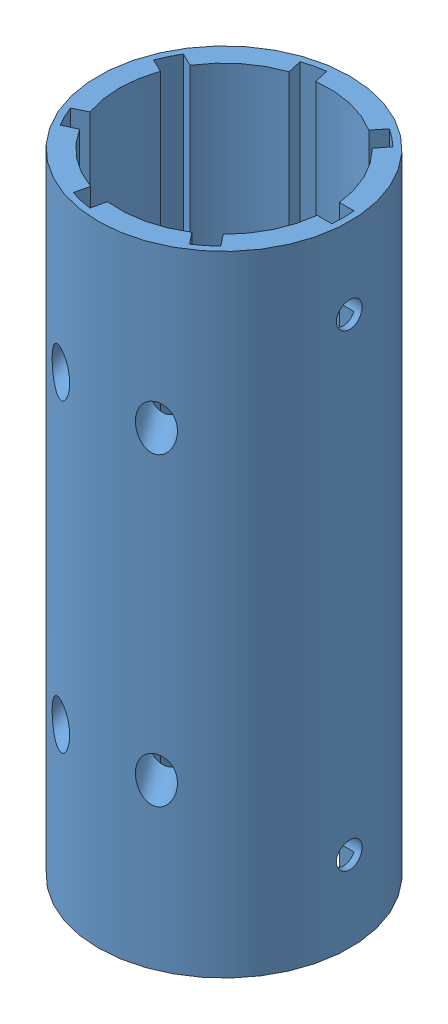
SolidWorks assembly 12- Bague hydrolube N° 116185.SLDASM, configuration Défaut (file format 4100). Lengths in mm.
Overall size (83 195 83).
2 component instances, 2 part files, 4 mates.
Components (placement in the parent):
- 12- Bague hydrolube N° 116185-1: 12- Bague hydrolube N° 116185.SLDPRT [Défaut] at (-18.7409 -101.104 0) size (83 195 83)
- 12bis- Bague hydrolube interieur N° 116185-1: 12bis- Bague hydrolube interieur N° 116185.SLDPRT [Défaut] at (-18.7409 -101.104 0) size (78 195 78)
Mates (geometry in assembly coordinates):
- Coaxiale1: concentric aligned: cylinder of 12- Bague hydrolube N° 116185-1 through (-18.7409 93.896 0) axis (0 -1 0) radius 39; cylinder of 12bis- Bague hydrolube interieur N° 116185-1 through (-18.7409 93.896 0) axis (0 -1 0) radius 39
- Coïncidente1: coincident = 18.7821 mm aligned: plane of ? through (-18.7409 93.896 0) normal (0 1 0); plane of ? through (-18.7409 93.896 0) normal (0 1 0)
- PLAN1: unknown = 143 mm: plane of ? through (-18.7409 -101.104 0) normal (0 1 0)
- Esquisse7: unknown = 52.0031 mm: unknown of ?; unknown of ?
